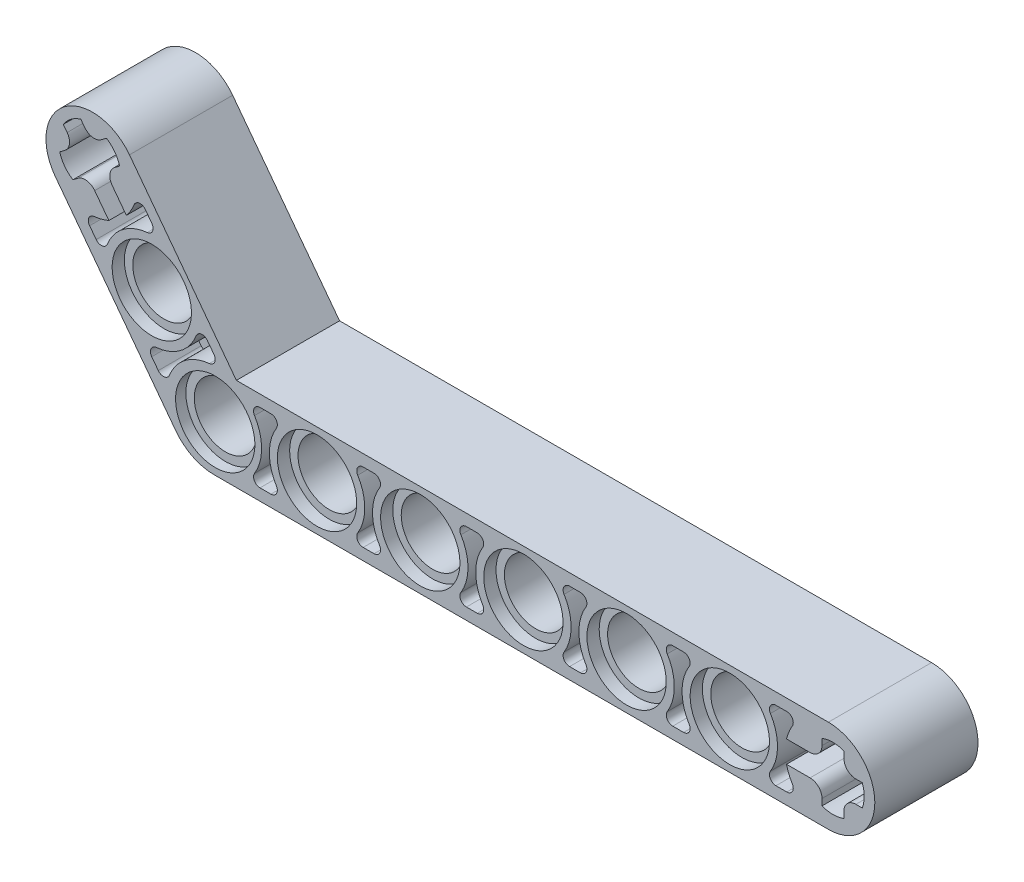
from build123d import *

# Parameters (mm, degrees)
EXTRUDE_1_DEPTH      = 8
CUT_EXTRUDE_1_DEPTH  = 55.287443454
CUT_EXTRUDE_2_DEPTH  = 55.287443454
CUT_EXTRUDE_START    = -3.325
CUT_EXTRUDE_3_DEPTH  = 3.325
CUT_EXTRUDE_4_DEPTH  = 3.325
CUT_EXTRUDE_5_DEPTH  = 3.325
CUT_EXTRUDE_6_DEPTH  = 3.325
CUT_EXTRUDE_7_DEPTH  = 3.325
CUT_EXTRUDE_8_DEPTH  = 3.325
CUT_EXTRUDE_9_DEPTH  = 3.325
CUT_EXTRUDE_10_DEPTH = 3.325
CUT_EXTRUDE_11_DEPTH = 3.325
CUT_EXTRUDE_12_DEPTH = 3.325
CUT_EXTRUDE_13_DEPTH = 3.325
CUT_EXTRUDE_14_DEPTH = 3.325
FILLET_1_R           = 0.924446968
FILLET_2_R           = 3.7


with BuildPart() as part:
    # Sketch 1 → Extrude 1 (new body)
    with BuildSketch(Plane.XY.offset(3.925)):
        with BuildLine():
            Line((47.64524805, 3.6), (1.745035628, 3.6))
            Line((1.745035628, 3.6), (-6.543566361, 14.599346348))
            ThreePointArc((-6.543566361, 14.599346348), (-11.58518828, 15.307900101), (-12.293742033, 10.266278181))
            Line((-12.293742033, 10.266278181), (-1.84475195, -3.6))
            Line((-1.84475195, -3.6), (47.64524805, -3.6))
            ThreePointArc((47.64524805, -3.6), (51.24524805, 0), (47.64524805, 3.6))
        make_face()
    extrude(amount=-EXTRUDE_1_DEPTH)

    # Sketch 2 → Cut-Extrude 1 (cut, through all)
    with BuildSketch(Plane.XY.offset(3.925)):
        with BuildLine():
            Line((48.85, -2.271150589), (48.85, -0.85))
            Line((48.85, -0.85), (50.271150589, -0.85))
            ThreePointArc((50.271150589, -0.85), (50.425, 0), (50.271150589, 0.85))
            Line((50.271150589, 0.85), (48.85, 0.85))
            Line((48.85, 0.85), (48.85, 2.271150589))
            ThreePointArc((48.85, 2.271150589), (48, 2.425), (47.15, 2.271150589))
            Line((47.15, 2.271150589), (47.15, 0.85))
            Line((47.15, 0.85), (44.398958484, 0.85))
            ThreePointArc((44.398958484, 0.85), (44.580032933, 1.412028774), (44.848208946, 1.938095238))
            ThreePointArc((44.848208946, 1.938095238), (44.858727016, 2.443975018), (44.422291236, 2.7))
            Line((44.422291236, 2.7), (43.577708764, 2.7))
            ThreePointArc((43.577708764, 2.7), (43.141272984, 2.443975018), (43.151791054, 1.938095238))
            ThreePointArc((43.151791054, 1.938095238), (43.7, 0), (43.151791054, -1.938095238))
            ThreePointArc((43.151791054, -1.938095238), (43.141272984, -2.443975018), (43.577708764, -2.7))
            Line((43.577708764, -2.7), (44.422291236, -2.7))
            ThreePointArc((44.422291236, -2.7), (44.858727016, -2.443975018), (44.848208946, -1.938095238))
            ThreePointArc((44.848208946, -1.938095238), (44.580032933, -1.412028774), (44.398958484, -0.85))
            Line((44.398958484, -0.85), (47.15, -0.85))
            Line((47.15, -0.85), (47.15, -2.271150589))
            ThreePointArc((47.15, -2.271150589), (48, -2.425), (48.85, -2.271150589))
        make_face()
    extrude(amount=-CUT_EXTRUDE_1_DEPTH, mode=Mode.SUBTRACT)

    # Sketch 3 → Cut-Extrude 2 (cut, through all)
    with BuildSketch(Plane(origin=(0, 0, -4.075), x_dir=(-1, 0, 0), z_dir=(0, 0, -1))):
        with BuildLine():
            Line((5.319605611, 11.54578346), (4.811323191, 10.871269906))
            ThreePointArc((4.811323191, 10.871269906), (4.753140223, 10.368637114), (5.163483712, 10.072591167))
            ThreePointArc((5.163483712, 10.072591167), (7.041235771, 9.344035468), (8.25914707, 7.739841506))
            ThreePointArc((8.25914707, 7.739841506), (8.656830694, 7.42699535), (9.123954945, 7.621468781))
            Line((9.123954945, 7.621468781), (9.632237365, 8.295982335))
            ThreePointArc((9.632237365, 8.295982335), (9.690420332, 8.798615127), (9.280076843, 9.094661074))
            ThreePointArc((9.280076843, 9.094661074), (8.698549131, 9.197080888), (8.140719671, 9.390705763))
            Line((8.140719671, 9.390705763), (9.796337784, 11.587785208))
            Line((9.796337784, 11.587785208), (10.93131911, 10.732515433))
            ThreePointArc((10.93131911, 10.732515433), (11.565731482, 11.31876673), (11.95440465, 12.0901958))
            Line((11.95440465, 12.0901958), (10.819423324, 12.945465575))
            Line((10.819423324, 12.945465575), (11.674693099, 14.0804469))
            ThreePointArc((11.674693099, 14.0804469), (11.088441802, 14.714859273), (10.317012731, 15.10353244))
            Line((10.317012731, 15.10353244), (9.461742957, 13.968551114))
            Line((9.461742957, 13.968551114), (8.326761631, 14.823820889))
            ThreePointArc((8.326761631, 14.823820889), (7.692349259, 14.237569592), (7.303676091, 13.466140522))
            Line((7.303676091, 13.466140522), (8.438657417, 12.610870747))
            Line((8.438657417, 12.610870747), (6.783039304, 10.413791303))
            ThreePointArc((6.783039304, 10.413791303), (6.443156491, 10.896641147), (6.184413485, 11.427410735))
            ThreePointArc((6.184413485, 11.427410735), (5.786729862, 11.740256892), (5.319605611, 11.54578346))
        make_face()
    extrude(amount=-CUT_EXTRUDE_2_DEPTH, mode=Mode.SUBTRACT)

    # Sketch 4 → Cut-Extrude 3 (cut)
    with BuildSketch(Plane.XY.offset(3.925).offset(CUT_EXTRUDE_START)):
        with BuildLine():
            Line((-4.81771718, 1.906898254), (-4.30943476, 1.232384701))
            ThreePointArc((-4.30943476, 1.232384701), (-3.842310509, 1.037911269), (-3.444626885, 1.350757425))
            ThreePointArc((-3.444626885, 1.350757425), (-2.226715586, 2.954951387), (-0.348963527, 3.683507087))
            ThreePointArc((-0.348963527, 3.683507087), (0.061379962, 3.979553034), (0.003196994, 4.482185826))
            Line((0.003196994, 4.482185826), (-0.505085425, 5.156699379))
            ThreePointArc((-0.505085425, 5.156699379), (-0.972209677, 5.351172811), (-1.3698933, 5.038326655))
            ThreePointArc((-1.3698933, 5.038326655), (-2.5878046, 3.434132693), (-4.465556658, 2.705576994))
            ThreePointArc((-4.465556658, 2.705576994), (-4.875900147, 2.409531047), (-4.81771718, 1.906898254))
        make_face()
    extrude(amount=CUT_EXTRUDE_3_DEPTH, mode=Mode.SUBTRACT)

    # Sketch 5 → Cut-Extrude 4 (cut)
    with BuildSketch(Plane.XY.offset(3.925)):
        with BuildLine():
            Line((11.577708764, -2.7), (12.422291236, -2.7))
            ThreePointArc((12.422291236, -2.7), (12.858727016, -2.443975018), (12.848208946, -1.938095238))
            ThreePointArc((12.848208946, -1.938095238), (12.3, 0), (12.848208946, 1.938095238))
            ThreePointArc((12.848208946, 1.938095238), (12.858727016, 2.443975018), (12.422291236, 2.7))
            Line((12.422291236, 2.7), (11.577708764, 2.7))
            ThreePointArc((11.577708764, 2.7), (11.141272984, 2.443975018), (11.151791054, 1.938095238))
            ThreePointArc((11.151791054, 1.938095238), (11.7, 0), (11.151791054, -1.938095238))
            ThreePointArc((11.151791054, -1.938095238), (11.141272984, -2.443975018), (11.577708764, -2.7))
        make_face()
    extrude(amount=-CUT_EXTRUDE_4_DEPTH, mode=Mode.SUBTRACT)

    # Sketch 6 → Cut-Extrude 5 (cut)
    with BuildSketch(Plane.XY.offset(3.925)):
        with BuildLine():
            Line((3.577708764, -2.7), (4.422291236, -2.7))
            ThreePointArc((4.422291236, -2.7), (4.858727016, -2.443975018), (4.848208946, -1.938095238))
            ThreePointArc((4.848208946, -1.938095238), (4.3, 0), (4.848208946, 1.938095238))
            ThreePointArc((4.848208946, 1.938095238), (4.858727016, 2.443975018), (4.422291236, 2.7))
            Line((4.422291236, 2.7), (3.577708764, 2.7))
            ThreePointArc((3.577708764, 2.7), (3.141272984, 2.443975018), (3.151791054, 1.938095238))
            ThreePointArc((3.151791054, 1.938095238), (3.7, 0), (3.151791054, -1.938095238))
            ThreePointArc((3.151791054, -1.938095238), (3.141272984, -2.443975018), (3.577708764, -2.7))
        make_face()
    extrude(amount=-CUT_EXTRUDE_5_DEPTH, mode=Mode.SUBTRACT)

    # Sketch 7 → Cut-Extrude 6 (cut)
    with BuildSketch(Plane.XY.offset(3.925)):
        with BuildLine():
            Line((19.577708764, -2.7), (20.422291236, -2.7))
            ThreePointArc((20.422291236, -2.7), (20.858727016, -2.443975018), (20.848208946, -1.938095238))
            ThreePointArc((20.848208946, -1.938095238), (20.3, 0), (20.848208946, 1.938095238))
            ThreePointArc((20.848208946, 1.938095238), (20.858727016, 2.443975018), (20.422291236, 2.7))
            Line((20.422291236, 2.7), (19.577708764, 2.7))
            ThreePointArc((19.577708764, 2.7), (19.141272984, 2.443975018), (19.151791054, 1.938095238))
            ThreePointArc((19.151791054, 1.938095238), (19.7, 0), (19.151791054, -1.938095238))
            ThreePointArc((19.151791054, -1.938095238), (19.141272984, -2.443975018), (19.577708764, -2.7))
        make_face()
    extrude(amount=-CUT_EXTRUDE_6_DEPTH, mode=Mode.SUBTRACT)

    # Sketch 8 → Cut-Extrude 7 (cut)
    with BuildSketch(Plane.XY.offset(3.925)):
        with BuildLine():
            Line((27.577708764, -2.7), (28.422291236, -2.7))
            ThreePointArc((28.422291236, -2.7), (28.858727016, -2.443975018), (28.848208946, -1.938095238))
            ThreePointArc((28.848208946, -1.938095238), (28.3, 0), (28.848208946, 1.938095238))
            ThreePointArc((28.848208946, 1.938095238), (28.858727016, 2.443975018), (28.422291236, 2.7))
            Line((28.422291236, 2.7), (27.577708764, 2.7))
            ThreePointArc((27.577708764, 2.7), (27.141272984, 2.443975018), (27.151791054, 1.938095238))
            ThreePointArc((27.151791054, 1.938095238), (27.7, 0), (27.151791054, -1.938095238))
            ThreePointArc((27.151791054, -1.938095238), (27.141272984, -2.443975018), (27.577708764, -2.7))
        make_face()
    extrude(amount=-CUT_EXTRUDE_7_DEPTH, mode=Mode.SUBTRACT)

    # Sketch 9 → Cut-Extrude 8 (cut)
    with BuildSketch(Plane.XY.offset(3.925)):
        with BuildLine():
            Line((35.577708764, -2.7), (36.422291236, -2.7))
            ThreePointArc((36.422291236, -2.7), (36.858727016, -2.443975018), (36.848208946, -1.938095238))
            ThreePointArc((36.848208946, -1.938095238), (36.3, 0), (36.848208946, 1.938095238))
            ThreePointArc((36.848208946, 1.938095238), (36.858727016, 2.443975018), (36.422291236, 2.7))
            Line((36.422291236, 2.7), (35.577708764, 2.7))
            ThreePointArc((35.577708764, 2.7), (35.141272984, 2.443975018), (35.151791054, 1.938095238))
            ThreePointArc((35.151791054, 1.938095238), (35.7, 0), (35.151791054, -1.938095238))
            ThreePointArc((35.151791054, -1.938095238), (35.141272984, -2.443975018), (35.577708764, -2.7))
        make_face()
    extrude(amount=-CUT_EXTRUDE_8_DEPTH, mode=Mode.SUBTRACT)

    # Sketch 10 → Cut-Extrude 9 (cut)
    with BuildSketch(Plane(origin=(0, 0, -4.075), x_dir=(-1, 0, 0), z_dir=(0, 0, -1))):
        with BuildLine():
            Line((0.505085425, 5.156699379), (-0.003196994, 4.482185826))
            ThreePointArc((-0.003196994, 4.482185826), (-0.061379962, 3.979553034), (0.348963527, 3.683507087))
            ThreePointArc((0.348963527, 3.683507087), (2.226715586, 2.954951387), (3.444626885, 1.350757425))
            ThreePointArc((3.444626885, 1.350757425), (3.842310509, 1.037911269), (4.30943476, 1.232384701))
            Line((4.30943476, 1.232384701), (4.81771718, 1.906898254))
            ThreePointArc((4.81771718, 1.906898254), (4.875900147, 2.409531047), (4.465556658, 2.705576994))
            ThreePointArc((4.465556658, 2.705576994), (2.5878046, 3.434132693), (1.3698933, 5.038326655))
            ThreePointArc((1.3698933, 5.038326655), (0.972209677, 5.351172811), (0.505085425, 5.156699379))
        make_face()
    extrude(amount=-CUT_EXTRUDE_9_DEPTH, mode=Mode.SUBTRACT)

    # Sketch 11 → Cut-Extrude 10 (cut)
    with BuildSketch(Plane(origin=(0, 0, -4.075), x_dir=(-1, 0, 0), z_dir=(0, 0, -1)).offset(CUT_EXTRUDE_START)):
        with BuildLine():
            Line((-12.422291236, -2.7), (-11.577708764, -2.7))
            ThreePointArc((-11.577708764, -2.7), (-11.141272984, -2.443975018), (-11.151791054, -1.938095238))
            ThreePointArc((-11.151791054, -1.938095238), (-11.7, 0), (-11.151791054, 1.938095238))
            ThreePointArc((-11.151791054, 1.938095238), (-11.141272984, 2.443975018), (-11.577708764, 2.7))
            Line((-11.577708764, 2.7), (-12.422291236, 2.7))
            ThreePointArc((-12.422291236, 2.7), (-12.858727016, 2.443975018), (-12.848208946, 1.938095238))
            ThreePointArc((-12.848208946, 1.938095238), (-12.3, 0), (-12.848208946, -1.938095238))
            ThreePointArc((-12.848208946, -1.938095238), (-12.858727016, -2.443975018), (-12.422291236, -2.7))
        make_face()
    extrude(amount=CUT_EXTRUDE_10_DEPTH, mode=Mode.SUBTRACT)

    # Sketch 12 → Cut-Extrude 11 (cut)
    with BuildSketch(Plane(origin=(0, 0, -4.075), x_dir=(-1, 0, 0), z_dir=(0, 0, -1)).offset(CUT_EXTRUDE_START)):
        with BuildLine():
            Line((-4.422291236, -2.7), (-3.577708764, -2.7))
            ThreePointArc((-3.577708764, -2.7), (-3.141272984, -2.443975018), (-3.151791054, -1.938095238))
            ThreePointArc((-3.151791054, -1.938095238), (-3.7, 0), (-3.151791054, 1.938095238))
            ThreePointArc((-3.151791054, 1.938095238), (-3.141272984, 2.443975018), (-3.577708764, 2.7))
            Line((-3.577708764, 2.7), (-4.422291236, 2.7))
            ThreePointArc((-4.422291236, 2.7), (-4.858727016, 2.443975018), (-4.848208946, 1.938095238))
            ThreePointArc((-4.848208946, 1.938095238), (-4.3, 0), (-4.848208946, -1.938095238))
            ThreePointArc((-4.848208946, -1.938095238), (-4.858727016, -2.443975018), (-4.422291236, -2.7))
        make_face()
    extrude(amount=CUT_EXTRUDE_11_DEPTH, mode=Mode.SUBTRACT)

    # Sketch 13 → Cut-Extrude 12 (cut)
    with BuildSketch(Plane(origin=(0, 0, -4.075), x_dir=(-1, 0, 0), z_dir=(0, 0, -1)).offset(CUT_EXTRUDE_START)):
        with BuildLine():
            Line((-20.422291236, -2.7), (-19.577708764, -2.7))
            ThreePointArc((-19.577708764, -2.7), (-19.141272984, -2.443975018), (-19.151791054, -1.938095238))
            ThreePointArc((-19.151791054, -1.938095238), (-19.7, 0), (-19.151791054, 1.938095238))
            ThreePointArc((-19.151791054, 1.938095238), (-19.141272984, 2.443975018), (-19.577708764, 2.7))
            Line((-19.577708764, 2.7), (-20.422291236, 2.7))
            ThreePointArc((-20.422291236, 2.7), (-20.858727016, 2.443975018), (-20.848208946, 1.938095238))
            ThreePointArc((-20.848208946, 1.938095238), (-20.3, 0), (-20.848208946, -1.938095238))
            ThreePointArc((-20.848208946, -1.938095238), (-20.858727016, -2.443975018), (-20.422291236, -2.7))
        make_face()
    extrude(amount=CUT_EXTRUDE_12_DEPTH, mode=Mode.SUBTRACT)

    # Sketch 14 → Cut-Extrude 13 (cut)
    with BuildSketch(Plane(origin=(0, 0, -4.075), x_dir=(-1, 0, 0), z_dir=(0, 0, -1)).offset(CUT_EXTRUDE_START)):
        with BuildLine():
            Line((-28.422291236, -2.7), (-27.577708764, -2.7))
            ThreePointArc((-27.577708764, -2.7), (-27.141272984, -2.443975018), (-27.151791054, -1.938095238))
            ThreePointArc((-27.151791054, -1.938095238), (-27.7, 0), (-27.151791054, 1.938095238))
            ThreePointArc((-27.151791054, 1.938095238), (-27.141272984, 2.443975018), (-27.577708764, 2.7))
            Line((-27.577708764, 2.7), (-28.422291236, 2.7))
            ThreePointArc((-28.422291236, 2.7), (-28.858727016, 2.443975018), (-28.848208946, 1.938095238))
            ThreePointArc((-28.848208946, 1.938095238), (-28.3, 0), (-28.848208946, -1.938095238))
            ThreePointArc((-28.848208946, -1.938095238), (-28.858727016, -2.443975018), (-28.422291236, -2.7))
        make_face()
    extrude(amount=CUT_EXTRUDE_13_DEPTH, mode=Mode.SUBTRACT)

    # Sketch 15 → Cut-Extrude 14 (cut)
    with BuildSketch(Plane(origin=(0, 0, -4.075), x_dir=(-1, 0, 0), z_dir=(0, 0, -1)).offset(CUT_EXTRUDE_START)):
        with BuildLine():
            Line((-36.422291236, -2.7), (-35.577708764, -2.7))
            ThreePointArc((-35.577708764, -2.7), (-35.141272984, -2.443975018), (-35.151791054, -1.938095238))
            ThreePointArc((-35.151791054, -1.938095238), (-35.7, 0), (-35.151791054, 1.938095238))
            ThreePointArc((-35.151791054, 1.938095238), (-35.141272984, 2.443975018), (-35.577708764, 2.7))
            Line((-35.577708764, 2.7), (-36.422291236, 2.7))
            ThreePointArc((-36.422291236, 2.7), (-36.858727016, 2.443975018), (-36.848208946, 1.938095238))
            ThreePointArc((-36.848208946, 1.938095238), (-36.3, 0), (-36.848208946, -1.938095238))
            ThreePointArc((-36.848208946, -1.938095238), (-36.858727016, -2.443975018), (-36.422291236, -2.7))
        make_face()
    extrude(amount=CUT_EXTRUDE_14_DEPTH, mode=Mode.SUBTRACT)

    # Sketch 16 → Cut-Revolve 1 (revolve, cut)
    with BuildSketch(Plane.XZ, mode=Mode.PRIVATE) as cut_revolve_1_sk:
        Polygon((3.178879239, 3.925), (0.103879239, 3.925), (0.103879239, -4.075), (3.178879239, -4.075), (3.178879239, -3.125), (2.528879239, -3.125), (2.528879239, 3.125), (3.178879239, 3.125), align=None)
    revolve(cut_revolve_1_sk.sketch.rotate(Axis((0.103879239, 0, 3.925), (0, 0, -1)), 180), axis=Axis((0.103879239, 0, 3.925), (0, 0, -1)), mode=Mode.SUBTRACT)

    # Sketch 17 → Cut-Revolve 2 (revolve, cut)
    with BuildSketch(Plane.XZ, mode=Mode.PRIVATE) as cut_revolve_2_sk:
        Polygon((11.075, 3.925), (8, 3.925), (8, -4.075), (11.075, -4.075), (11.075, -3.275), (10.425, -3.275), (10.425, 2.975), (11.075, 2.975), align=None)
    revolve(cut_revolve_2_sk.sketch.rotate(Axis((8, 0, 3.925), (0, 0, -1)), 180), axis=Axis((8, 0, 3.925), (0, 0, -1)), mode=Mode.SUBTRACT)

    # Sketch 18 → Cut-Revolve 3 (revolve, cut)
    with BuildSketch(Plane.XZ, mode=Mode.PRIVATE) as cut_revolve_3_sk:
        Polygon((19.075, 3.925), (16, 3.925), (16, -4.075), (19.075, -4.075), (19.075, -3.275), (18.425, -3.275), (18.425, 2.975), (19.075, 2.975), align=None)
    revolve(cut_revolve_3_sk.sketch.rotate(Axis((16, 0, 3.925), (0, 0, -1)), 180), axis=Axis((16, 0, 3.925), (0, 0, -1)), mode=Mode.SUBTRACT)

    # Sketch 19 → Cut-Revolve 4 (revolve, cut)
    with BuildSketch(Plane.XZ, mode=Mode.PRIVATE) as cut_revolve_4_sk:
        Polygon((27.075, 3.925), (24, 3.925), (24, -4.075), (27.075, -4.075), (27.075, -3.275), (26.425, -3.275), (26.425, 2.975), (27.075, 2.975), align=None)
    revolve(cut_revolve_4_sk.sketch.rotate(Axis((24, 0, 3.925), (0, 0, -1)), 180), axis=Axis((24, 0, 3.925), (0, 0, -1)), mode=Mode.SUBTRACT)

    # Sketch 20 → Cut-Revolve 5 (revolve, cut)
    with BuildSketch(Plane.XZ, mode=Mode.PRIVATE) as cut_revolve_5_sk:
        Polygon((35.075, 3.925), (32, 3.925), (32, -4.075), (35.075, -4.075), (35.075, -3.275), (34.425, -3.275), (34.425, 2.975), (35.075, 2.975), align=None)
    revolve(cut_revolve_5_sk.sketch.rotate(Axis((32, 0, 3.925), (0, 0, -1)), 180), axis=Axis((32, 0, 3.925), (0, 0, -1)), mode=Mode.SUBTRACT)

    # Sketch 21 → Cut-Revolve 6 (revolve, cut)
    with BuildSketch(Plane.XZ, mode=Mode.PRIVATE) as cut_revolve_6_sk:
        Polygon((43.075, 3.925), (40, 3.925), (40, -4.075), (43.075, -4.075), (43.075, -3.275), (42.425, -3.275), (42.425, 2.975), (43.075, 2.975), align=None)
    revolve(cut_revolve_6_sk.sketch.rotate(Axis((40, 0, 3.925), (0, 0, -1)), 180), axis=Axis((40, 0, 3.925), (0, 0, -1)), mode=Mode.SUBTRACT)

    # Sketch 22 → Cut-Revolve 7 (revolve, cut)
    with BuildSketch(Plane.XZ.offset(-6.38908408), mode=Mode.PRIVATE) as cut_revolve_7_sk:
        Polygon((-1.739520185, 3.925), (-4.814520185, 3.925), (-4.814520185, -4.075), (-1.739520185, -4.075), (-1.739520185, -3.275), (-2.389520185, -3.275), (-2.389520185, 2.975), (-1.739520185, 2.975), align=None)
    revolve(cut_revolve_7_sk.sketch.rotate(Axis((-4.814520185, 6.38908408, 3.925), (0, 0, -1)), 180), axis=Axis((-4.814520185, 6.38908408, 3.925), (0, 0, -1)), mode=Mode.SUBTRACT)

    # Fillet 1
    fillet_1_edges = [part.edges().sort_by_distance(p)[0] for p in [
        (-8.438657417, 12.610870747, -0.075),
        (-9.461742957, 13.968551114, -0.075),
        (-10.819423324, 12.945465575, -0.075),
        (-9.796337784, 11.587785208, -0.075),
        (47.15, -0.85, -0.075),
        (47.15, 0.85, -0.075),
        (48.85, 0.85, -0.075),
        (48.85, -0.85, -0.075),
    ]]
    fillet(fillet_1_edges, radius=FILLET_1_R)

    # Fillet 2
    fillet_2_edges = [part.edges().sort_by_distance(p)[0] for p in [
        (-1.84475195, -3.6, -0.075),
    ]]
    fillet(fillet_2_edges, radius=FILLET_2_R)


solid = part.part
